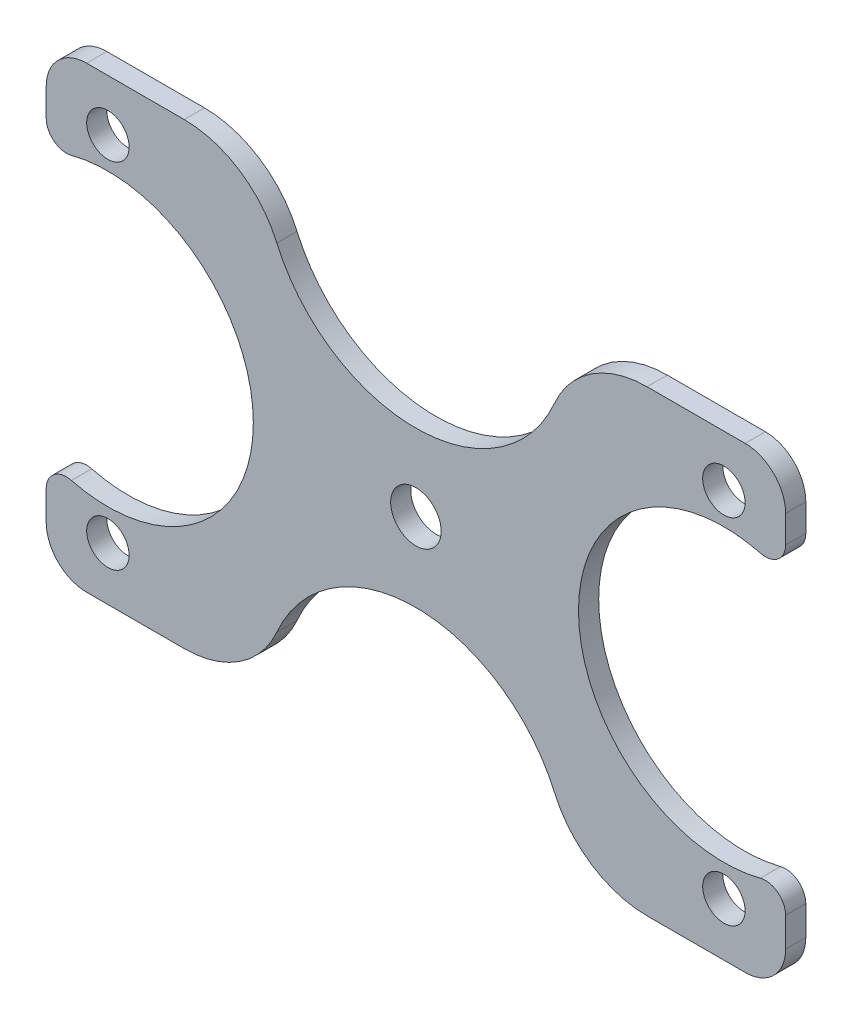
ISO-10303-21;
HEADER;
FILE_DESCRIPTION(('STEP AP214'),'2;1');
FILE_NAME('part.step','',(''),(''),'','','');
FILE_SCHEMA(('AUTOMOTIVE_DESIGN { 1 0 10303 214 1 1 1 1 }'));
ENDSEC;
DATA;
#1=APPLICATION_CONTEXT('core data for automotive mechanical design processes');
#2=APPLICATION_PROTOCOL_DEFINITION('international standard','automotive_design',2000,#1);
#3=PRODUCT_CONTEXT('',#1,'mechanical');
#4=PRODUCT('Part','Part','',(#3));
#5=PRODUCT_RELATED_PRODUCT_CATEGORY('part','',(#4));
#6=PRODUCT_DEFINITION_FORMATION('','',#4);
#7=PRODUCT_DEFINITION_CONTEXT('part definition',#1,'design');
#8=PRODUCT_DEFINITION('design','',#6,#7);
#9=PRODUCT_DEFINITION_SHAPE('','',#8);
#10=(LENGTH_UNIT() NAMED_UNIT(*) SI_UNIT(.MILLI.,.METRE.));
#11=(NAMED_UNIT(*) PLANE_ANGLE_UNIT() SI_UNIT($,.RADIAN.));
#12=(NAMED_UNIT(*) SI_UNIT($,.STERADIAN.) SOLID_ANGLE_UNIT());
#13=UNCERTAINTY_MEASURE_WITH_UNIT(LENGTH_MEASURE(1.E-05),#10,'distance_accuracy_value','');
#14=(GEOMETRIC_REPRESENTATION_CONTEXT(3) GLOBAL_UNCERTAINTY_ASSIGNED_CONTEXT((#13)) GLOBAL_UNIT_ASSIGNED_CONTEXT((#10,
#11,#12)) REPRESENTATION_CONTEXT('',''));
#15=CARTESIAN_POINT('',(0.,0.,0.));
#16=DIRECTION('',(0.,0.,1.));
#17=DIRECTION('',(1.,0.,0.));
#18=AXIS2_PLACEMENT_3D('',#15,#16,#17);
#19=CARTESIAN_POINT('',(32.6101683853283,18.5968085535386,2.));
#20=DIRECTION('',(0.,0.,-1.));
#21=DIRECTION('',(-1.,0.,0.));
#22=AXIS2_PLACEMENT_3D('',#19,#20,#21);
#23=CYLINDRICAL_SURFACE('',#22,4.);
#24=CARTESIAN_POINT('',(32.6101683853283,18.5968085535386,0.));
#25=DIRECTION('',(0.,0.,1.));
#26=DIRECTION('',(1.,0.,0.));
#27=AXIS2_PLACEMENT_3D('',#24,#25,#26);
#28=CIRCLE('',#27,4.);
#29=CARTESIAN_POINT('',(32.6101683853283,22.5968085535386,0.));
#30=VERTEX_POINT('',#29);
#31=CARTESIAN_POINT('',(36.6101683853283,18.5968085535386,0.));
#32=VERTEX_POINT('',#31);
#33=EDGE_CURVE('E239',#30,#32,#28,.F.);
#34=ORIENTED_EDGE('',*,*,#33,.F.);
#35=DIRECTION('',(0.,0.,-1.));
#36=VECTOR('',#35,1.);
#37=CARTESIAN_POINT('',(32.6101683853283,22.5968085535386,2.));
#38=LINE('',#37,#36);
#39=CARTESIAN_POINT('',(32.6101683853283,22.5968085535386,2.));
#40=VERTEX_POINT('',#39);
#41=EDGE_CURVE('E11',#40,#30,#38,.T.);
#42=ORIENTED_EDGE('',*,*,#41,.F.);
#43=CARTESIAN_POINT('',(32.6101683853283,18.5968085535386,2.));
#44=DIRECTION('',(0.,0.,1.));
#45=DIRECTION('',(1.,0.,0.));
#46=AXIS2_PLACEMENT_3D('',#43,#44,#45);
#47=CIRCLE('',#46,4.);
#48=CARTESIAN_POINT('',(36.6101683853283,18.5968085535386,2.));
#49=VERTEX_POINT('',#48);
#50=EDGE_CURVE('E318',#40,#49,#47,.F.);
#51=ORIENTED_EDGE('',*,*,#50,.T.);
#52=DIRECTION('',(0.,0.,-1.));
#53=VECTOR('',#52,1.);
#54=CARTESIAN_POINT('',(36.6101683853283,18.5968085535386,2.));
#55=LINE('',#54,#53);
#56=EDGE_CURVE('E132',#49,#32,#55,.T.);
#57=ORIENTED_EDGE('',*,*,#56,.T.);
#58=EDGE_LOOP('',(#34,#42,#51,#57));
#59=FACE_BOUND('',#58,.T.);
#60=ADVANCED_FACE('F34',(#59),#23,.T.);
#61=CARTESIAN_POINT('',(0.,22.5968085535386,2.));
#62=DIRECTION('',(0.,1.,0.));
#63=DIRECTION('',(0.,0.,1.));
#64=AXIS2_PLACEMENT_3D('',#61,#62,#63);
#65=PLANE('',#64);
#66=DIRECTION('',(1.,0.,0.));
#67=VECTOR('',#66,1.);
#68=CARTESIAN_POINT('',(0.,22.5968085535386,0.));
#69=LINE('',#68,#67);
#70=CARTESIAN_POINT('',(22.8878164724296,22.5968085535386,0.));
#71=VERTEX_POINT('',#70);
#72=EDGE_CURVE('E242',#71,#30,#69,.T.);
#73=ORIENTED_EDGE('',*,*,#72,.F.);
#74=DIRECTION('',(0.,0.,-1.));
#75=VECTOR('',#74,1.);
#76=CARTESIAN_POINT('',(22.8878164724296,22.5968085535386,2.));
#77=LINE('',#76,#75);
#78=CARTESIAN_POINT('',(22.8878164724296,22.5968085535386,2.));
#79=VERTEX_POINT('',#78);
#80=EDGE_CURVE('E42',#79,#71,#77,.T.);
#81=ORIENTED_EDGE('',*,*,#80,.F.);
#82=DIRECTION('',(1.,0.,0.));
#83=VECTOR('',#82,1.);
#84=CARTESIAN_POINT('',(0.,22.5968085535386,2.));
#85=LINE('',#84,#83);
#86=EDGE_CURVE('E376',#79,#40,#85,.T.);
#87=ORIENTED_EDGE('',*,*,#86,.T.);
#88=ORIENTED_EDGE('',*,*,#41,.T.);
#89=EDGE_LOOP('',(#73,#81,#87,#88));
#90=FACE_BOUND('',#89,.T.);
#91=ADVANCED_FACE('F375',(#90),#65,.T.);
#92=CARTESIAN_POINT('',(22.8878164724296,12.5968085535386,2.));
#93=DIRECTION('',(0.,0.,-1.));
#94=DIRECTION('',(-1.,0.,0.));
#95=AXIS2_PLACEMENT_3D('',#92,#93,#94);
#96=CYLINDRICAL_SURFACE('',#95,10.);
#97=CARTESIAN_POINT('',(22.8878164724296,12.5968085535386,0.));
#98=DIRECTION('',(0.,0.,1.));
#99=DIRECTION('',(1.,0.,0.));
#100=AXIS2_PLACEMENT_3D('',#97,#98,#99);
#101=CIRCLE('',#100,10.);
#102=CARTESIAN_POINT('',(13.7226650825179,16.5968085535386,0.));
#103=VERTEX_POINT('',#102);
#104=EDGE_CURVE('E245',#71,#103,#101,.T.);
#105=ORIENTED_EDGE('',*,*,#104,.T.);
#106=DIRECTION('',(0.,0.,-1.));
#107=VECTOR('',#106,1.);
#108=CARTESIAN_POINT('',(13.7226650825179,16.5968085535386,2.));
#109=LINE('',#108,#107);
#110=CARTESIAN_POINT('',(13.7226650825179,16.5968085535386,2.));
#111=VERTEX_POINT('',#110);
#112=EDGE_CURVE('E360',#111,#103,#109,.T.);
#113=ORIENTED_EDGE('',*,*,#112,.F.);
#114=CARTESIAN_POINT('',(22.8878164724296,12.5968085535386,2.));
#115=DIRECTION('',(0.,0.,1.));
#116=DIRECTION('',(1.,0.,0.));
#117=AXIS2_PLACEMENT_3D('',#114,#115,#116);
#118=CIRCLE('',#117,10.);
#119=EDGE_CURVE('E366',#79,#111,#118,.T.);
#120=ORIENTED_EDGE('',*,*,#119,.F.);
#121=ORIENTED_EDGE('',*,*,#80,.T.);
#122=EDGE_LOOP('',(#105,#113,#120,#121));
#123=FACE_BOUND('',#122,.T.);
#124=ADVANCED_FACE('F364',(#123),#96,.T.);
#125=CARTESIAN_POINT('',(-0.0250620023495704,22.5968085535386,2.));
#126=DIRECTION('',(0.,0.,-1.));
#127=DIRECTION('',(-1.,0.,0.));
#128=AXIS2_PLACEMENT_3D('',#125,#126,#127);
#129=CYLINDRICAL_SURFACE('',#128,15.);
#130=CARTESIAN_POINT('',(-0.0250620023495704,22.5968085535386,0.));
#131=DIRECTION('',(0.,0.,1.));
#132=DIRECTION('',(1.,0.,0.));
#133=AXIS2_PLACEMENT_3D('',#130,#131,#132);
#134=CIRCLE('',#133,15.);
#135=CARTESIAN_POINT('',(-13.7727890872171,16.5968085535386,0.));
#136=VERTEX_POINT('',#135);
#137=EDGE_CURVE('E248',#136,#103,#134,.T.);
#138=ORIENTED_EDGE('',*,*,#137,.F.);
#139=DIRECTION('',(0.,0.,-1.));
#140=VECTOR('',#139,1.);
#141=CARTESIAN_POINT('',(-13.7727890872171,16.5968085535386,2.));
#142=LINE('',#141,#140);
#143=CARTESIAN_POINT('',(-13.7727890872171,16.5968085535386,2.));
#144=VERTEX_POINT('',#143);
#145=EDGE_CURVE('E358',#144,#136,#142,.T.);
#146=ORIENTED_EDGE('',*,*,#145,.F.);
#147=CARTESIAN_POINT('',(-0.0250620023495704,22.5968085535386,2.));
#148=DIRECTION('',(0.,0.,1.));
#149=DIRECTION('',(1.,0.,0.));
#150=AXIS2_PLACEMENT_3D('',#147,#148,#149);
#151=CIRCLE('',#150,15.);
#152=EDGE_CURVE('E382',#144,#111,#151,.T.);
#153=ORIENTED_EDGE('',*,*,#152,.T.);
#154=ORIENTED_EDGE('',*,*,#112,.T.);
#155=EDGE_LOOP('',(#138,#146,#153,#154));
#156=FACE_BOUND('',#155,.T.);
#157=ADVANCED_FACE('F499',(#156),#129,.F.);
#158=CARTESIAN_POINT('',(-22.9379404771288,12.5968085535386,2.));
#159=DIRECTION('',(0.,0.,-1.));
#160=DIRECTION('',(-1.,0.,0.));
#161=AXIS2_PLACEMENT_3D('',#158,#159,#160);
#162=CYLINDRICAL_SURFACE('',#161,10.);
#163=CARTESIAN_POINT('',(-22.9379404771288,12.5968085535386,0.));
#164=DIRECTION('',(0.,0.,1.));
#165=DIRECTION('',(1.,0.,0.));
#166=AXIS2_PLACEMENT_3D('',#163,#164,#165);
#167=CIRCLE('',#166,10.);
#168=CARTESIAN_POINT('',(-22.9379404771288,22.5968085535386,0.));
#169=VERTEX_POINT('',#168);
#170=EDGE_CURVE('E251',#169,#136,#167,.F.);
#171=ORIENTED_EDGE('',*,*,#170,.F.);
#172=DIRECTION('',(0.,0.,-1.));
#173=VECTOR('',#172,1.);
#174=CARTESIAN_POINT('',(-22.9379404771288,22.5968085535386,2.));
#175=LINE('',#174,#173);
#176=CARTESIAN_POINT('',(-22.9379404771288,22.5968085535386,2.));
#177=VERTEX_POINT('',#176);
#178=EDGE_CURVE('E356',#177,#169,#175,.T.);
#179=ORIENTED_EDGE('',*,*,#178,.F.);
#180=CARTESIAN_POINT('',(-22.9379404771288,12.5968085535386,2.));
#181=DIRECTION('',(0.,0.,1.));
#182=DIRECTION('',(1.,0.,0.));
#183=AXIS2_PLACEMENT_3D('',#180,#181,#182);
#184=CIRCLE('',#183,10.);
#185=EDGE_CURVE('E385',#177,#144,#184,.F.);
#186=ORIENTED_EDGE('',*,*,#185,.T.);
#187=ORIENTED_EDGE('',*,*,#145,.T.);
#188=EDGE_LOOP('',(#171,#179,#186,#187));
#189=FACE_BOUND('',#188,.T.);
#190=ADVANCED_FACE('F496',(#189),#162,.T.);
#191=CARTESIAN_POINT('',(0.,22.5968085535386,2.));
#192=DIRECTION('',(0.,1.,0.));
#193=DIRECTION('',(0.,0.,1.));
#194=AXIS2_PLACEMENT_3D('',#191,#192,#193);
#195=PLANE('',#194);
#196=DIRECTION('',(1.,0.,0.));
#197=VECTOR('',#196,1.);
#198=CARTESIAN_POINT('',(0.,22.5968085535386,0.));
#199=LINE('',#198,#197);
#200=CARTESIAN_POINT('',(-32.6101683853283,22.5968085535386,0.));
#201=VERTEX_POINT('',#200);
#202=EDGE_CURVE('E254',#201,#169,#199,.T.);
#203=ORIENTED_EDGE('',*,*,#202,.F.);
#204=DIRECTION('',(0.,0.,-1.));
#205=VECTOR('',#204,1.);
#206=CARTESIAN_POINT('',(-32.6101683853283,22.5968085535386,2.));
#207=LINE('',#206,#205);
#208=CARTESIAN_POINT('',(-32.6101683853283,22.5968085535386,2.));
#209=VERTEX_POINT('',#208);
#210=EDGE_CURVE('E354',#209,#201,#207,.T.);
#211=ORIENTED_EDGE('',*,*,#210,.F.);
#212=DIRECTION('',(1.,0.,0.));
#213=VECTOR('',#212,1.);
#214=CARTESIAN_POINT('',(0.,22.5968085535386,2.));
#215=LINE('',#214,#213);
#216=EDGE_CURVE('E388',#209,#177,#215,.T.);
#217=ORIENTED_EDGE('',*,*,#216,.T.);
#218=ORIENTED_EDGE('',*,*,#178,.T.);
#219=EDGE_LOOP('',(#203,#211,#217,#218));
#220=FACE_BOUND('',#219,.T.);
#221=ADVANCED_FACE('F492',(#220),#195,.T.);
#222=CARTESIAN_POINT('',(-32.6101683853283,18.5968085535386,2.));
#223=DIRECTION('',(0.,0.,-1.));
#224=DIRECTION('',(-1.,0.,0.));
#225=AXIS2_PLACEMENT_3D('',#222,#223,#224);
#226=CYLINDRICAL_SURFACE('',#225,4.);
#227=CARTESIAN_POINT('',(-32.6101683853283,18.5968085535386,0.));
#228=DIRECTION('',(0.,0.,1.));
#229=DIRECTION('',(1.,0.,0.));
#230=AXIS2_PLACEMENT_3D('',#227,#228,#229);
#231=CIRCLE('',#230,4.);
#232=CARTESIAN_POINT('',(-36.6101683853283,18.5968085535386,0.));
#233=VERTEX_POINT('',#232);
#234=EDGE_CURVE('E257',#233,#201,#231,.F.);
#235=ORIENTED_EDGE('',*,*,#234,.F.);
#236=DIRECTION('',(0.,0.,-1.));
#237=VECTOR('',#236,1.);
#238=CARTESIAN_POINT('',(-36.6101683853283,18.5968085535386,2.));
#239=LINE('',#238,#237);
#240=CARTESIAN_POINT('',(-36.6101683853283,18.5968085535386,2.));
#241=VERTEX_POINT('',#240);
#242=EDGE_CURVE('E352',#241,#233,#239,.T.);
#243=ORIENTED_EDGE('',*,*,#242,.F.);
#244=CARTESIAN_POINT('',(-32.6101683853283,18.5968085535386,2.));
#245=DIRECTION('',(0.,0.,1.));
#246=DIRECTION('',(1.,0.,0.));
#247=AXIS2_PLACEMENT_3D('',#244,#245,#246);
#248=CIRCLE('',#247,4.);
#249=EDGE_CURVE('E391',#241,#209,#248,.F.);
#250=ORIENTED_EDGE('',*,*,#249,.T.);
#251=ORIENTED_EDGE('',*,*,#210,.T.);
#252=EDGE_LOOP('',(#235,#243,#250,#251));
#253=FACE_BOUND('',#252,.T.);
#254=ADVANCED_FACE('F488',(#253),#226,.T.);
#255=CARTESIAN_POINT('',(-36.6101683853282,0.,2.));
#256=DIRECTION('',(-1.,0.,0.));
#257=DIRECTION('',(0.,-1.,0.));
#258=AXIS2_PLACEMENT_3D('',#255,#256,#257);
#259=PLANE('',#258);
#260=DIRECTION('',(0.,1.,0.));
#261=VECTOR('',#260,1.);
#262=CARTESIAN_POINT('',(-36.6101683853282,0.,0.));
#263=LINE('',#262,#261);
#264=CARTESIAN_POINT('',(-36.6101683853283,15.8766027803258,0.));
#265=VERTEX_POINT('',#264);
#266=EDGE_CURVE('E260',#265,#233,#263,.T.);
#267=ORIENTED_EDGE('',*,*,#266,.F.);
#268=DIRECTION('',(0.,0.,-1.));
#269=VECTOR('',#268,1.);
#270=CARTESIAN_POINT('',(-36.6101683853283,15.8766027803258,2.));
#271=LINE('',#270,#269);
#272=CARTESIAN_POINT('',(-36.6101683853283,15.8766027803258,2.));
#273=VERTEX_POINT('',#272);
#274=EDGE_CURVE('E350',#273,#265,#271,.T.);
#275=ORIENTED_EDGE('',*,*,#274,.F.);
#276=DIRECTION('',(0.,1.,0.));
#277=VECTOR('',#276,1.);
#278=CARTESIAN_POINT('',(-36.6101683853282,0.,2.));
#279=LINE('',#278,#277);
#280=EDGE_CURVE('E394',#273,#241,#279,.T.);
#281=ORIENTED_EDGE('',*,*,#280,.T.);
#282=ORIENTED_EDGE('',*,*,#242,.T.);
#283=EDGE_LOOP('',(#267,#275,#281,#282));
#284=FACE_BOUND('',#283,.T.);
#285=ADVANCED_FACE('F482',(#284),#259,.T.);
#286=CARTESIAN_POINT('',(-34.6101683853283,15.8766027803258,2.));
#287=DIRECTION('',(0.,0.,-1.));
#288=DIRECTION('',(-1.,0.,0.));
#289=AXIS2_PLACEMENT_3D('',#286,#287,#288);
#290=CYLINDRICAL_SURFACE('',#289,2.);
#291=CARTESIAN_POINT('',(-34.6101683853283,15.8766027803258,0.));
#292=DIRECTION('',(0.,0.,1.));
#293=DIRECTION('',(1.,0.,0.));
#294=AXIS2_PLACEMENT_3D('',#291,#292,#293);
#295=CIRCLE('',#294,2.);
#296=CARTESIAN_POINT('',(-34.108928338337,13.9404317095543,0.));
#297=VERTEX_POINT('',#296);
#298=EDGE_CURVE('E263',#265,#297,#295,.T.);
#299=ORIENTED_EDGE('',*,*,#298,.T.);
#300=DIRECTION('',(0.,0.,-1.));
#301=VECTOR('',#300,1.);
#302=CARTESIAN_POINT('',(-34.108928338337,13.9404317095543,2.));
#303=LINE('',#302,#301);
#304=CARTESIAN_POINT('',(-34.108928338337,13.9404317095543,2.));
#305=VERTEX_POINT('',#304);
#306=EDGE_CURVE('E347',#305,#297,#303,.T.);
#307=ORIENTED_EDGE('',*,*,#306,.F.);
#308=CARTESIAN_POINT('',(-34.6101683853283,15.8766027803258,2.));
#309=DIRECTION('',(0.,0.,1.));
#310=DIRECTION('',(1.,0.,0.));
#311=AXIS2_PLACEMENT_3D('',#308,#309,#310);
#312=CIRCLE('',#311,2.);
#313=EDGE_CURVE('E397',#273,#305,#312,.T.);
#314=ORIENTED_EDGE('',*,*,#313,.F.);
#315=ORIENTED_EDGE('',*,*,#274,.T.);
#316=EDGE_LOOP('',(#299,#307,#314,#315));
#317=FACE_BOUND('',#316,.T.);
#318=ADVANCED_FACE('F500',(#317),#290,.T.);
#319=CARTESIAN_POINT('',(-30.5,0.,2.));
#320=DIRECTION('',(0.,0.,-1.));
#321=DIRECTION('',(-1.,0.,0.));
#322=AXIS2_PLACEMENT_3D('',#319,#320,#321);
#323=CYLINDRICAL_SURFACE('',#322,14.4);
#324=CARTESIAN_POINT('',(-30.5,0.,0.));
#325=DIRECTION('',(0.,0.,1.));
#326=DIRECTION('',(1.,0.,0.));
#327=AXIS2_PLACEMENT_3D('',#324,#325,#326);
#328=CIRCLE('',#327,14.4);
#329=CARTESIAN_POINT('',(-34.108928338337,-13.9404317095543,0.));
#330=VERTEX_POINT('',#329);
#331=EDGE_CURVE('E265',#297,#330,#328,.F.);
#332=ORIENTED_EDGE('',*,*,#331,.T.);
#333=DIRECTION('',(0.,0.,-1.));
#334=VECTOR('',#333,1.);
#335=CARTESIAN_POINT('',(-34.108928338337,-13.9404317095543,2.));
#336=LINE('',#335,#334);
#337=CARTESIAN_POINT('',(-34.108928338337,-13.9404317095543,2.));
#338=VERTEX_POINT('',#337);
#339=EDGE_CURVE('E344',#338,#330,#336,.T.);
#340=ORIENTED_EDGE('',*,*,#339,.F.);
#341=CARTESIAN_POINT('',(-30.5,0.,2.));
#342=DIRECTION('',(0.,0.,1.));
#343=DIRECTION('',(1.,0.,0.));
#344=AXIS2_PLACEMENT_3D('',#341,#342,#343);
#345=CIRCLE('',#344,14.4);
#346=EDGE_CURVE('E399',#305,#338,#345,.F.);
#347=ORIENTED_EDGE('',*,*,#346,.F.);
#348=ORIENTED_EDGE('',*,*,#306,.T.);
#349=EDGE_LOOP('',(#332,#340,#347,#348));
#350=FACE_BOUND('',#349,.T.);
#351=ADVANCED_FACE('F476',(#350),#323,.F.);
#352=CARTESIAN_POINT('',(-34.6101683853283,-15.8766027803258,2.));
#353=DIRECTION('',(0.,0.,-1.));
#354=DIRECTION('',(-1.,0.,0.));
#355=AXIS2_PLACEMENT_3D('',#352,#353,#354);
#356=CYLINDRICAL_SURFACE('',#355,2.);
#357=CARTESIAN_POINT('',(-34.6101683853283,-15.8766027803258,0.));
#358=DIRECTION('',(0.,0.,1.));
#359=DIRECTION('',(1.,0.,0.));
#360=AXIS2_PLACEMENT_3D('',#357,#358,#359);
#361=CIRCLE('',#360,2.);
#362=CARTESIAN_POINT('',(-36.6101683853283,-15.8766027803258,0.));
#363=VERTEX_POINT('',#362);
#364=EDGE_CURVE('E267',#330,#363,#361,.T.);
#365=ORIENTED_EDGE('',*,*,#364,.T.);
#366=DIRECTION('',(0.,0.,-1.));
#367=VECTOR('',#366,1.);
#368=CARTESIAN_POINT('',(-36.6101683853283,-15.8766027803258,2.));
#369=LINE('',#368,#367);
#370=CARTESIAN_POINT('',(-36.6101683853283,-15.8766027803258,2.));
#371=VERTEX_POINT('',#370);
#372=EDGE_CURVE('E341',#371,#363,#369,.T.);
#373=ORIENTED_EDGE('',*,*,#372,.F.);
#374=CARTESIAN_POINT('',(-34.6101683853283,-15.8766027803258,2.));
#375=DIRECTION('',(0.,0.,1.));
#376=DIRECTION('',(1.,0.,0.));
#377=AXIS2_PLACEMENT_3D('',#374,#375,#376);
#378=CIRCLE('',#377,2.);
#379=EDGE_CURVE('E401',#338,#371,#378,.T.);
#380=ORIENTED_EDGE('',*,*,#379,.F.);
#381=ORIENTED_EDGE('',*,*,#339,.T.);
#382=EDGE_LOOP('',(#365,#373,#380,#381));
#383=FACE_BOUND('',#382,.T.);
#384=ADVANCED_FACE('F472',(#383),#356,.T.);
#385=CARTESIAN_POINT('',(-36.6101683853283,0.,2.));
#386=DIRECTION('',(1.,0.,0.));
#387=DIRECTION('',(0.,0.,-1.));
#388=AXIS2_PLACEMENT_3D('',#385,#386,#387);
#389=PLANE('',#388);
#390=DIRECTION('',(0.,-1.,0.));
#391=VECTOR('',#390,1.);
#392=CARTESIAN_POINT('',(-36.6101683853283,0.,0.));
#393=LINE('',#392,#391);
#394=CARTESIAN_POINT('',(-36.6101683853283,-18.7777972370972,0.));
#395=VERTEX_POINT('',#394);
#396=EDGE_CURVE('E269',#363,#395,#393,.T.);
#397=ORIENTED_EDGE('',*,*,#396,.T.);
#398=DIRECTION('',(0.,0.,-1.));
#399=VECTOR('',#398,1.);
#400=CARTESIAN_POINT('',(-36.6101683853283,-18.7777972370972,2.));
#401=LINE('',#400,#399);
#402=CARTESIAN_POINT('',(-36.6101683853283,-18.7777972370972,2.));
#403=VERTEX_POINT('',#402);
#404=EDGE_CURVE('E339',#403,#395,#401,.T.);
#405=ORIENTED_EDGE('',*,*,#404,.F.);
#406=DIRECTION('',(0.,-1.,0.));
#407=VECTOR('',#406,1.);
#408=CARTESIAN_POINT('',(-36.6101683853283,0.,2.));
#409=LINE('',#408,#407);
#410=EDGE_CURVE('E403',#371,#403,#409,.T.);
#411=ORIENTED_EDGE('',*,*,#410,.F.);
#412=ORIENTED_EDGE('',*,*,#372,.T.);
#413=EDGE_LOOP('',(#397,#405,#411,#412));
#414=FACE_BOUND('',#413,.T.);
#415=ADVANCED_FACE('F467',(#414),#389,.F.);
#416=CARTESIAN_POINT('',(-32.6101683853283,-18.7777972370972,2.));
#417=DIRECTION('',(0.,0.,-1.));
#418=DIRECTION('',(-1.,0.,0.));
#419=AXIS2_PLACEMENT_3D('',#416,#417,#418);
#420=CYLINDRICAL_SURFACE('',#419,4.);
#421=CARTESIAN_POINT('',(-32.6101683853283,-18.7777972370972,0.));
#422=DIRECTION('',(0.,0.,1.));
#423=DIRECTION('',(1.,0.,0.));
#424=AXIS2_PLACEMENT_3D('',#421,#422,#423);
#425=CIRCLE('',#424,4.);
#426=CARTESIAN_POINT('',(-32.6101683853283,-22.7777972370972,0.));
#427=VERTEX_POINT('',#426);
#428=EDGE_CURVE('E272',#427,#395,#425,.F.);
#429=ORIENTED_EDGE('',*,*,#428,.F.);
#430=DIRECTION('',(0.,0.,-1.));
#431=VECTOR('',#430,1.);
#432=CARTESIAN_POINT('',(-32.6101683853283,-22.7777972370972,2.));
#433=LINE('',#432,#431);
#434=CARTESIAN_POINT('',(-32.6101683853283,-22.7777972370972,2.));
#435=VERTEX_POINT('',#434);
#436=EDGE_CURVE('E337',#435,#427,#433,.T.);
#437=ORIENTED_EDGE('',*,*,#436,.F.);
#438=CARTESIAN_POINT('',(-32.6101683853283,-18.7777972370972,2.));
#439=DIRECTION('',(0.,0.,1.));
#440=DIRECTION('',(1.,0.,0.));
#441=AXIS2_PLACEMENT_3D('',#438,#439,#440);
#442=CIRCLE('',#441,4.);
#443=EDGE_CURVE('E405',#435,#403,#442,.F.);
#444=ORIENTED_EDGE('',*,*,#443,.T.);
#445=ORIENTED_EDGE('',*,*,#404,.T.);
#446=EDGE_LOOP('',(#429,#437,#444,#445));
#447=FACE_BOUND('',#446,.T.);
#448=ADVANCED_FACE('F461',(#447),#420,.T.);
#449=CARTESIAN_POINT('',(0.,-22.7777972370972,2.));
#450=DIRECTION('',(0.,-1.,0.));
#451=DIRECTION('',(0.,0.,-1.));
#452=AXIS2_PLACEMENT_3D('',#449,#450,#451);
#453=PLANE('',#452);
#454=DIRECTION('',(-1.,0.,0.));
#455=VECTOR('',#454,1.);
#456=CARTESIAN_POINT('',(0.,-22.7777972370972,0.));
#457=LINE('',#456,#455);
#458=CARTESIAN_POINT('',(-22.9379404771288,-22.7777972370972,0.));
#459=VERTEX_POINT('',#458);
#460=EDGE_CURVE('E275',#459,#427,#457,.T.);
#461=ORIENTED_EDGE('',*,*,#460,.F.);
#462=DIRECTION('',(0.,0.,-1.));
#463=VECTOR('',#462,1.);
#464=CARTESIAN_POINT('',(-22.9379404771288,-22.7777972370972,2.));
#465=LINE('',#464,#463);
#466=CARTESIAN_POINT('',(-22.9379404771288,-22.7777972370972,2.));
#467=VERTEX_POINT('',#466);
#468=EDGE_CURVE('E335',#467,#459,#465,.T.);
#469=ORIENTED_EDGE('',*,*,#468,.F.);
#470=DIRECTION('',(-1.,0.,0.));
#471=VECTOR('',#470,1.);
#472=CARTESIAN_POINT('',(0.,-22.7777972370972,2.));
#473=LINE('',#472,#471);
#474=EDGE_CURVE('E408',#467,#435,#473,.T.);
#475=ORIENTED_EDGE('',*,*,#474,.T.);
#476=ORIENTED_EDGE('',*,*,#436,.T.);
#477=EDGE_LOOP('',(#461,#469,#475,#476));
#478=FACE_BOUND('',#477,.T.);
#479=ADVANCED_FACE('F457',(#478),#453,.T.);
#480=CARTESIAN_POINT('',(-22.9379404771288,-12.7777972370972,2.));
#481=DIRECTION('',(0.,0.,-1.));
#482=DIRECTION('',(-1.,0.,0.));
#483=AXIS2_PLACEMENT_3D('',#480,#481,#482);
#484=CYLINDRICAL_SURFACE('',#483,10.);
#485=CARTESIAN_POINT('',(-22.9379404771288,-12.7777972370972,0.));
#486=DIRECTION('',(0.,0.,1.));
#487=DIRECTION('',(1.,0.,0.));
#488=AXIS2_PLACEMENT_3D('',#485,#486,#487);
#489=CIRCLE('',#488,10.);
#490=CARTESIAN_POINT('',(-13.7727890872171,-16.7777972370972,0.));
#491=VERTEX_POINT('',#490);
#492=EDGE_CURVE('E278',#459,#491,#489,.T.);
#493=ORIENTED_EDGE('',*,*,#492,.T.);
#494=DIRECTION('',(0.,0.,-1.));
#495=VECTOR('',#494,1.);
#496=CARTESIAN_POINT('',(-13.7727890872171,-16.7777972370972,2.));
#497=LINE('',#496,#495);
#498=CARTESIAN_POINT('',(-13.7727890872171,-16.7777972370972,2.));
#499=VERTEX_POINT('',#498);
#500=EDGE_CURVE('E332',#499,#491,#497,.T.);
#501=ORIENTED_EDGE('',*,*,#500,.F.);
#502=CARTESIAN_POINT('',(-22.9379404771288,-12.7777972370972,2.));
#503=DIRECTION('',(0.,0.,1.));
#504=DIRECTION('',(1.,0.,0.));
#505=AXIS2_PLACEMENT_3D('',#502,#503,#504);
#506=CIRCLE('',#505,10.);
#507=EDGE_CURVE('E411',#467,#499,#506,.T.);
#508=ORIENTED_EDGE('',*,*,#507,.F.);
#509=ORIENTED_EDGE('',*,*,#468,.T.);
#510=EDGE_LOOP('',(#493,#501,#508,#509));
#511=FACE_BOUND('',#510,.T.);
#512=ADVANCED_FACE('F453',(#511),#484,.T.);
#513=CARTESIAN_POINT('',(-0.0250620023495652,-22.7777972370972,2.));
#514=DIRECTION('',(0.,0.,-1.));
#515=DIRECTION('',(-1.,0.,0.));
#516=AXIS2_PLACEMENT_3D('',#513,#514,#515);
#517=CYLINDRICAL_SURFACE('',#516,15.);
#518=CARTESIAN_POINT('',(-0.0250620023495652,-22.7777972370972,0.));
#519=DIRECTION('',(0.,0.,1.));
#520=DIRECTION('',(1.,0.,0.));
#521=AXIS2_PLACEMENT_3D('',#518,#519,#520);
#522=CIRCLE('',#521,15.);
#523=CARTESIAN_POINT('',(13.722665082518,-16.7777972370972,0.));
#524=VERTEX_POINT('',#523);
#525=EDGE_CURVE('E280',#491,#524,#522,.F.);
#526=ORIENTED_EDGE('',*,*,#525,.T.);
#527=DIRECTION('',(0.,0.,-1.));
#528=VECTOR('',#527,1.);
#529=CARTESIAN_POINT('',(13.722665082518,-16.7777972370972,2.));
#530=LINE('',#529,#528);
#531=CARTESIAN_POINT('',(13.722665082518,-16.7777972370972,2.));
#532=VERTEX_POINT('',#531);
#533=EDGE_CURVE('E330',#532,#524,#530,.T.);
#534=ORIENTED_EDGE('',*,*,#533,.F.);
#535=CARTESIAN_POINT('',(-0.0250620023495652,-22.7777972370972,2.));
#536=DIRECTION('',(0.,0.,1.));
#537=DIRECTION('',(1.,0.,0.));
#538=AXIS2_PLACEMENT_3D('',#535,#536,#537);
#539=CIRCLE('',#538,15.);
#540=EDGE_CURVE('E413',#499,#532,#539,.F.);
#541=ORIENTED_EDGE('',*,*,#540,.F.);
#542=ORIENTED_EDGE('',*,*,#500,.T.);
#543=EDGE_LOOP('',(#526,#534,#541,#542));
#544=FACE_BOUND('',#543,.T.);
#545=ADVANCED_FACE('F449',(#544),#517,.F.);
#546=CARTESIAN_POINT('',(22.8878164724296,-12.7777972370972,2.));
#547=DIRECTION('',(0.,0.,-1.));
#548=DIRECTION('',(-1.,0.,0.));
#549=AXIS2_PLACEMENT_3D('',#546,#547,#548);
#550=CYLINDRICAL_SURFACE('',#549,10.);
#551=CARTESIAN_POINT('',(22.8878164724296,-12.7777972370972,0.));
#552=DIRECTION('',(0.,0.,1.));
#553=DIRECTION('',(1.,0.,0.));
#554=AXIS2_PLACEMENT_3D('',#551,#552,#553);
#555=CIRCLE('',#554,10.);
#556=CARTESIAN_POINT('',(22.8878164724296,-22.7777972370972,0.));
#557=VERTEX_POINT('',#556);
#558=EDGE_CURVE('E283',#557,#524,#555,.F.);
#559=ORIENTED_EDGE('',*,*,#558,.F.);
#560=DIRECTION('',(0.,0.,-1.));
#561=VECTOR('',#560,1.);
#562=CARTESIAN_POINT('',(22.8878164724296,-22.7777972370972,2.));
#563=LINE('',#562,#561);
#564=CARTESIAN_POINT('',(22.8878164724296,-22.7777972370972,2.));
#565=VERTEX_POINT('',#564);
#566=EDGE_CURVE('E328',#565,#557,#563,.T.);
#567=ORIENTED_EDGE('',*,*,#566,.F.);
#568=CARTESIAN_POINT('',(22.8878164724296,-12.7777972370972,2.));
#569=DIRECTION('',(0.,0.,1.));
#570=DIRECTION('',(1.,0.,0.));
#571=AXIS2_PLACEMENT_3D('',#568,#569,#570);
#572=CIRCLE('',#571,10.);
#573=EDGE_CURVE('E415',#565,#532,#572,.F.);
#574=ORIENTED_EDGE('',*,*,#573,.T.);
#575=ORIENTED_EDGE('',*,*,#533,.T.);
#576=EDGE_LOOP('',(#559,#567,#574,#575));
#577=FACE_BOUND('',#576,.T.);
#578=ADVANCED_FACE('F444',(#577),#550,.T.);
#579=CARTESIAN_POINT('',(0.,-22.7777972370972,2.));
#580=DIRECTION('',(0.,-1.,0.));
#581=DIRECTION('',(1.,0.,0.));
#582=AXIS2_PLACEMENT_3D('',#579,#580,#581);
#583=PLANE('',#582);
#584=DIRECTION('',(-1.,0.,0.));
#585=VECTOR('',#584,1.);
#586=CARTESIAN_POINT('',(0.,-22.7777972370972,0.));
#587=LINE('',#586,#585);
#588=CARTESIAN_POINT('',(32.6101683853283,-22.7777972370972,0.));
#589=VERTEX_POINT('',#588);
#590=EDGE_CURVE('E286',#589,#557,#587,.T.);
#591=ORIENTED_EDGE('',*,*,#590,.F.);
#592=DIRECTION('',(0.,0.,-1.));
#593=VECTOR('',#592,1.);
#594=CARTESIAN_POINT('',(32.6101683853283,-22.7777972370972,2.));
#595=LINE('',#594,#593);
#596=CARTESIAN_POINT('',(32.6101683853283,-22.7777972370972,2.));
#597=VERTEX_POINT('',#596);
#598=EDGE_CURVE('E326',#597,#589,#595,.T.);
#599=ORIENTED_EDGE('',*,*,#598,.F.);
#600=DIRECTION('',(-1.,0.,0.));
#601=VECTOR('',#600,1.);
#602=CARTESIAN_POINT('',(0.,-22.7777972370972,2.));
#603=LINE('',#602,#601);
#604=EDGE_CURVE('E418',#597,#565,#603,.T.);
#605=ORIENTED_EDGE('',*,*,#604,.T.);
#606=ORIENTED_EDGE('',*,*,#566,.T.);
#607=EDGE_LOOP('',(#591,#599,#605,#606));
#608=FACE_BOUND('',#607,.T.);
#609=ADVANCED_FACE('F439',(#608),#583,.T.);
#610=CARTESIAN_POINT('',(32.6101683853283,-18.7777972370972,2.));
#611=DIRECTION('',(0.,0.,-1.));
#612=DIRECTION('',(-1.,0.,0.));
#613=AXIS2_PLACEMENT_3D('',#610,#611,#612);
#614=CYLINDRICAL_SURFACE('',#613,4.);
#615=CARTESIAN_POINT('',(32.6101683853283,-18.7777972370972,0.));
#616=DIRECTION('',(0.,0.,1.));
#617=DIRECTION('',(1.,0.,0.));
#618=AXIS2_PLACEMENT_3D('',#615,#616,#617);
#619=CIRCLE('',#618,4.);
#620=CARTESIAN_POINT('',(36.6101683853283,-18.7777972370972,0.));
#621=VERTEX_POINT('',#620);
#622=EDGE_CURVE('E289',#621,#589,#619,.F.);
#623=ORIENTED_EDGE('',*,*,#622,.F.);
#624=DIRECTION('',(0.,0.,-1.));
#625=VECTOR('',#624,1.);
#626=CARTESIAN_POINT('',(36.6101683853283,-18.7777972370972,2.));
#627=LINE('',#626,#625);
#628=CARTESIAN_POINT('',(36.6101683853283,-18.7777972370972,2.));
#629=VERTEX_POINT('',#628);
#630=EDGE_CURVE('E324',#629,#621,#627,.T.);
#631=ORIENTED_EDGE('',*,*,#630,.F.);
#632=CARTESIAN_POINT('',(32.6101683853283,-18.7777972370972,2.));
#633=DIRECTION('',(0.,0.,1.));
#634=DIRECTION('',(1.,0.,0.));
#635=AXIS2_PLACEMENT_3D('',#632,#633,#634);
#636=CIRCLE('',#635,4.);
#637=EDGE_CURVE('E421',#629,#597,#636,.F.);
#638=ORIENTED_EDGE('',*,*,#637,.T.);
#639=ORIENTED_EDGE('',*,*,#598,.T.);
#640=EDGE_LOOP('',(#623,#631,#638,#639));
#641=FACE_BOUND('',#640,.T.);
#642=ADVANCED_FACE('F435',(#641),#614,.T.);
#643=CARTESIAN_POINT('',(36.6101683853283,0.,2.));
#644=DIRECTION('',(1.,0.,0.));
#645=DIRECTION('',(0.,1.,0.));
#646=AXIS2_PLACEMENT_3D('',#643,#644,#645);
#647=PLANE('',#646);
#648=DIRECTION('',(0.,-1.,0.));
#649=VECTOR('',#648,1.);
#650=CARTESIAN_POINT('',(36.6101683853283,0.,0.));
#651=LINE('',#650,#649);
#652=CARTESIAN_POINT('',(36.6101683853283,-15.8766027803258,0.));
#653=VERTEX_POINT('',#652);
#654=EDGE_CURVE('E292',#653,#621,#651,.T.);
#655=ORIENTED_EDGE('',*,*,#654,.F.);
#656=DIRECTION('',(0.,0.,-1.));
#657=VECTOR('',#656,1.);
#658=CARTESIAN_POINT('',(36.6101683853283,-15.8766027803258,2.));
#659=LINE('',#658,#657);
#660=CARTESIAN_POINT('',(36.6101683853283,-15.8766027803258,2.));
#661=VERTEX_POINT('',#660);
#662=EDGE_CURVE('E322',#661,#653,#659,.T.);
#663=ORIENTED_EDGE('',*,*,#662,.F.);
#664=DIRECTION('',(0.,-1.,0.));
#665=VECTOR('',#664,1.);
#666=CARTESIAN_POINT('',(36.6101683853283,0.,2.));
#667=LINE('',#666,#665);
#668=EDGE_CURVE('E424',#661,#629,#667,.T.);
#669=ORIENTED_EDGE('',*,*,#668,.T.);
#670=ORIENTED_EDGE('',*,*,#630,.T.);
#671=EDGE_LOOP('',(#655,#663,#669,#670));
#672=FACE_BOUND('',#671,.T.);
#673=ADVANCED_FACE('F432',(#672),#647,.T.);
#674=CARTESIAN_POINT('',(34.6101683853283,-15.8766027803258,2.));
#675=DIRECTION('',(0.,0.,-1.));
#676=DIRECTION('',(-1.,0.,0.));
#677=AXIS2_PLACEMENT_3D('',#674,#675,#676);
#678=CYLINDRICAL_SURFACE('',#677,2.);
#679=CARTESIAN_POINT('',(34.6101683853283,-15.8766027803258,0.));
#680=DIRECTION('',(0.,0.,1.));
#681=DIRECTION('',(1.,0.,0.));
#682=AXIS2_PLACEMENT_3D('',#679,#680,#681);
#683=CIRCLE('',#682,2.);
#684=CARTESIAN_POINT('',(34.108928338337,-13.9404317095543,0.));
#685=VERTEX_POINT('',#684);
#686=EDGE_CURVE('E295',#685,#653,#683,.F.);
#687=ORIENTED_EDGE('',*,*,#686,.F.);
#688=DIRECTION('',(0.,0.,-1.));
#689=VECTOR('',#688,1.);
#690=CARTESIAN_POINT('',(34.108928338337,-13.9404317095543,2.));
#691=LINE('',#690,#689);
#692=CARTESIAN_POINT('',(34.108928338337,-13.9404317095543,2.));
#693=VERTEX_POINT('',#692);
#694=EDGE_CURVE('E209',#693,#685,#691,.T.);
#695=ORIENTED_EDGE('',*,*,#694,.F.);
#696=CARTESIAN_POINT('',(34.6101683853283,-15.8766027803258,2.));
#697=DIRECTION('',(0.,0.,1.));
#698=DIRECTION('',(1.,0.,0.));
#699=AXIS2_PLACEMENT_3D('',#696,#697,#698);
#700=CIRCLE('',#699,2.);
#701=EDGE_CURVE('E217',#693,#661,#700,.F.);
#702=ORIENTED_EDGE('',*,*,#701,.T.);
#703=ORIENTED_EDGE('',*,*,#662,.T.);
#704=EDGE_LOOP('',(#687,#695,#702,#703));
#705=FACE_BOUND('',#704,.T.);
#706=ADVANCED_FACE('F428',(#705),#678,.T.);
#707=CARTESIAN_POINT('',(30.5,0.,2.));
#708=DIRECTION('',(0.,0.,-1.));
#709=DIRECTION('',(-1.,0.,0.));
#710=AXIS2_PLACEMENT_3D('',#707,#708,#709);
#711=CYLINDRICAL_SURFACE('',#710,14.4);
#712=CARTESIAN_POINT('',(30.5,0.,0.));
#713=DIRECTION('',(0.,0.,1.));
#714=DIRECTION('',(1.,0.,0.));
#715=AXIS2_PLACEMENT_3D('',#712,#713,#714);
#716=CIRCLE('',#715,14.4);
#717=CARTESIAN_POINT('',(34.108928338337,13.9404317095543,0.));
#718=VERTEX_POINT('',#717);
#719=EDGE_CURVE('E204',#718,#685,#716,.T.);
#720=ORIENTED_EDGE('',*,*,#719,.F.);
#721=DIRECTION('',(0.,0.,-1.));
#722=VECTOR('',#721,1.);
#723=CARTESIAN_POINT('',(34.108928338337,13.9404317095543,2.));
#724=LINE('',#723,#722);
#725=CARTESIAN_POINT('',(34.108928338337,13.9404317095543,2.));
#726=VERTEX_POINT('',#725);
#727=EDGE_CURVE('E199',#726,#718,#724,.T.);
#728=ORIENTED_EDGE('',*,*,#727,.F.);
#729=CARTESIAN_POINT('',(30.5,0.,2.));
#730=DIRECTION('',(0.,0.,1.));
#731=DIRECTION('',(1.,0.,0.));
#732=AXIS2_PLACEMENT_3D('',#729,#730,#731);
#733=CIRCLE('',#732,14.4);
#734=EDGE_CURVE('E202',#726,#693,#733,.T.);
#735=ORIENTED_EDGE('',*,*,#734,.T.);
#736=ORIENTED_EDGE('',*,*,#694,.T.);
#737=EDGE_LOOP('',(#720,#728,#735,#736));
#738=FACE_BOUND('',#737,.T.);
#739=ADVANCED_FACE('F201',(#738),#711,.F.);
#740=CARTESIAN_POINT('',(34.6101683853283,15.8766027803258,2.));
#741=DIRECTION('',(0.,0.,-1.));
#742=DIRECTION('',(-1.,0.,0.));
#743=AXIS2_PLACEMENT_3D('',#740,#741,#742);
#744=CYLINDRICAL_SURFACE('',#743,2.);
#745=CARTESIAN_POINT('',(34.6101683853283,15.8766027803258,0.));
#746=DIRECTION('',(0.,0.,1.));
#747=DIRECTION('',(1.,0.,0.));
#748=AXIS2_PLACEMENT_3D('',#745,#746,#747);
#749=CIRCLE('',#748,2.);
#750=CARTESIAN_POINT('',(36.6101683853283,15.8766027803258,0.));
#751=VERTEX_POINT('',#750);
#752=EDGE_CURVE('E299',#751,#718,#749,.F.);
#753=ORIENTED_EDGE('',*,*,#752,.F.);
#754=DIRECTION('',(0.,0.,-1.));
#755=VECTOR('',#754,1.);
#756=CARTESIAN_POINT('',(36.6101683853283,15.8766027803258,2.));
#757=LINE('',#756,#755);
#758=CARTESIAN_POINT('',(36.6101683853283,15.8766027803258,2.));
#759=VERTEX_POINT('',#758);
#760=EDGE_CURVE('E125',#759,#751,#757,.T.);
#761=ORIENTED_EDGE('',*,*,#760,.F.);
#762=CARTESIAN_POINT('',(34.6101683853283,15.8766027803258,2.));
#763=DIRECTION('',(0.,0.,1.));
#764=DIRECTION('',(1.,0.,0.));
#765=AXIS2_PLACEMENT_3D('',#762,#763,#764);
#766=CIRCLE('',#765,2.);
#767=EDGE_CURVE('E214',#759,#726,#766,.F.);
#768=ORIENTED_EDGE('',*,*,#767,.T.);
#769=ORIENTED_EDGE('',*,*,#727,.T.);
#770=EDGE_LOOP('',(#753,#761,#768,#769));
#771=FACE_BOUND('',#770,.T.);
#772=ADVANCED_FACE('F219',(#771),#744,.T.);
#773=CARTESIAN_POINT('',(-30.5,17.5,2.));
#774=DIRECTION('',(0.,0.,-1.));
#775=DIRECTION('',(-1.,0.,0.));
#776=AXIS2_PLACEMENT_3D('',#773,#774,#775);
#777=CYLINDRICAL_SURFACE('',#776,2.1);
#778=CARTESIAN_POINT('',(-30.5,17.5,2.));
#779=DIRECTION('',(0.,0.,1.));
#780=DIRECTION('',(1.,0.,0.));
#781=AXIS2_PLACEMENT_3D('',#778,#779,#780);
#782=CIRCLE('',#781,2.1);
#783=CARTESIAN_POINT('',(-28.4,17.5,2.));
#784=VERTEX_POINT('',#783);
#785=EDGE_CURVE('E233',#784,#784,#782,.T.);
#786=ORIENTED_EDGE('',*,*,#785,.T.);
#787=EDGE_LOOP('',(#786));
#788=FACE_BOUND('',#787,.T.);
#789=CARTESIAN_POINT('',(-30.5,17.5,0.));
#790=DIRECTION('',(0.,0.,1.));
#791=DIRECTION('',(1.,0.,0.));
#792=AXIS2_PLACEMENT_3D('',#789,#790,#791);
#793=CIRCLE('',#792,2.1);
#794=CARTESIAN_POINT('',(-28.4,17.5,0.));
#795=VERTEX_POINT('',#794);
#796=EDGE_CURVE('E312',#795,#795,#793,.T.);
#797=ORIENTED_EDGE('',*,*,#796,.F.);
#798=EDGE_LOOP('',(#797));
#799=FACE_BOUND('',#798,.T.);
#800=ADVANCED_FACE('F648',(#788,#799),#777,.F.);
#801=CARTESIAN_POINT('',(-30.5,-17.5,2.));
#802=DIRECTION('',(0.,0.,-1.));
#803=DIRECTION('',(-1.,0.,0.));
#804=AXIS2_PLACEMENT_3D('',#801,#802,#803);
#805=CYLINDRICAL_SURFACE('',#804,2.1);
#806=CARTESIAN_POINT('',(-30.5,-17.5,2.));
#807=DIRECTION('',(0.,0.,1.));
#808=DIRECTION('',(1.,0.,0.));
#809=AXIS2_PLACEMENT_3D('',#806,#807,#808);
#810=CIRCLE('',#809,2.1);
#811=CARTESIAN_POINT('',(-28.4,-17.5,2.));
#812=VERTEX_POINT('',#811);
#813=EDGE_CURVE('E230',#812,#812,#810,.T.);
#814=ORIENTED_EDGE('',*,*,#813,.T.);
#815=EDGE_LOOP('',(#814));
#816=FACE_BOUND('',#815,.T.);
#817=CARTESIAN_POINT('',(-30.5,-17.5,0.));
#818=DIRECTION('',(0.,0.,1.));
#819=DIRECTION('',(1.,0.,0.));
#820=AXIS2_PLACEMENT_3D('',#817,#818,#819);
#821=CIRCLE('',#820,2.1);
#822=CARTESIAN_POINT('',(-28.4,-17.5,0.));
#823=VERTEX_POINT('',#822);
#824=EDGE_CURVE('E309',#823,#823,#821,.T.);
#825=ORIENTED_EDGE('',*,*,#824,.F.);
#826=EDGE_LOOP('',(#825));
#827=FACE_BOUND('',#826,.T.);
#828=ADVANCED_FACE('F657',(#816,#827),#805,.F.);
#829=CARTESIAN_POINT('',(30.5,-17.5,2.));
#830=DIRECTION('',(0.,0.,-1.));
#831=DIRECTION('',(-1.,0.,0.));
#832=AXIS2_PLACEMENT_3D('',#829,#830,#831);
#833=CYLINDRICAL_SURFACE('',#832,2.1);
#834=CARTESIAN_POINT('',(30.5,-17.5,2.));
#835=DIRECTION('',(0.,0.,1.));
#836=DIRECTION('',(1.,0.,0.));
#837=AXIS2_PLACEMENT_3D('',#834,#835,#836);
#838=CIRCLE('',#837,2.1);
#839=CARTESIAN_POINT('',(32.6,-17.5,2.));
#840=VERTEX_POINT('',#839);
#841=EDGE_CURVE('E227',#840,#840,#838,.T.);
#842=ORIENTED_EDGE('',*,*,#841,.T.);
#843=EDGE_LOOP('',(#842));
#844=FACE_BOUND('',#843,.T.);
#845=CARTESIAN_POINT('',(30.5,-17.5,0.));
#846=DIRECTION('',(0.,0.,1.));
#847=DIRECTION('',(1.,0.,0.));
#848=AXIS2_PLACEMENT_3D('',#845,#846,#847);
#849=CIRCLE('',#848,2.1);
#850=CARTESIAN_POINT('',(32.6,-17.5,0.));
#851=VERTEX_POINT('',#850);
#852=EDGE_CURVE('E306',#851,#851,#849,.T.);
#853=ORIENTED_EDGE('',*,*,#852,.F.);
#854=EDGE_LOOP('',(#853));
#855=FACE_BOUND('',#854,.T.);
#856=ADVANCED_FACE('F667',(#844,#855),#833,.F.);
#857=CARTESIAN_POINT('',(30.5,17.5,2.));
#858=DIRECTION('',(0.,0.,-1.));
#859=DIRECTION('',(-1.,0.,0.));
#860=AXIS2_PLACEMENT_3D('',#857,#858,#859);
#861=CYLINDRICAL_SURFACE('',#860,2.1);
#862=CARTESIAN_POINT('',(30.5,17.5,2.));
#863=DIRECTION('',(0.,0.,1.));
#864=DIRECTION('',(1.,0.,0.));
#865=AXIS2_PLACEMENT_3D('',#862,#863,#864);
#866=CIRCLE('',#865,2.1);
#867=CARTESIAN_POINT('',(32.6,17.5,2.));
#868=VERTEX_POINT('',#867);
#869=EDGE_CURVE('E221',#868,#868,#866,.T.);
#870=ORIENTED_EDGE('',*,*,#869,.T.);
#871=EDGE_LOOP('',(#870));
#872=FACE_BOUND('',#871,.T.);
#873=CARTESIAN_POINT('',(30.5,17.5,0.));
#874=DIRECTION('',(0.,0.,1.));
#875=DIRECTION('',(1.,0.,0.));
#876=AXIS2_PLACEMENT_3D('',#873,#874,#875);
#877=CIRCLE('',#876,2.1);
#878=CARTESIAN_POINT('',(32.6,17.5,0.));
#879=VERTEX_POINT('',#878);
#880=EDGE_CURVE('E303',#879,#879,#877,.T.);
#881=ORIENTED_EDGE('',*,*,#880,.F.);
#882=EDGE_LOOP('',(#881));
#883=FACE_BOUND('',#882,.T.);
#884=ADVANCED_FACE('F677',(#872,#883),#861,.F.);
#885=CARTESIAN_POINT('',(36.6101683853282,0.,2.));
#886=DIRECTION('',(-1.,0.,0.));
#887=DIRECTION('',(0.,-1.,0.));
#888=AXIS2_PLACEMENT_3D('',#885,#886,#887);
#889=PLANE('',#888);
#890=DIRECTION('',(0.,1.,0.));
#891=VECTOR('',#890,1.);
#892=CARTESIAN_POINT('',(36.6101683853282,0.,0.));
#893=LINE('',#892,#891);
#894=EDGE_CURVE('E301',#751,#32,#893,.T.);
#895=ORIENTED_EDGE('',*,*,#894,.T.);
#896=ORIENTED_EDGE('',*,*,#56,.F.);
#897=DIRECTION('',(0.,1.,0.));
#898=VECTOR('',#897,1.);
#899=CARTESIAN_POINT('',(36.6101683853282,0.,2.));
#900=LINE('',#899,#898);
#901=EDGE_CURVE('E50',#759,#49,#900,.T.);
#902=ORIENTED_EDGE('',*,*,#901,.F.);
#903=ORIENTED_EDGE('',*,*,#760,.T.);
#904=EDGE_LOOP('',(#895,#896,#902,#903));
#905=FACE_BOUND('',#904,.T.);
#906=ADVANCED_FACE('F377',(#905),#889,.F.);
#907=CARTESIAN_POINT('',(0.,0.,2.));
#908=DIRECTION('',(0.,0.,-1.));
#909=DIRECTION('',(-1.,0.,0.));
#910=AXIS2_PLACEMENT_3D('',#907,#908,#909);
#911=CYLINDRICAL_SURFACE('',#910,2.5);
#912=CARTESIAN_POINT('',(0.,0.,2.));
#913=DIRECTION('',(0.,0.,1.));
#914=DIRECTION('',(1.,0.,0.));
#915=AXIS2_PLACEMENT_3D('',#912,#913,#914);
#916=CIRCLE('',#915,2.5);
#917=CARTESIAN_POINT('',(2.5,0.,2.));
#918=VERTEX_POINT('',#917);
#919=EDGE_CURVE('E236',#918,#918,#916,.T.);
#920=ORIENTED_EDGE('',*,*,#919,.T.);
#921=EDGE_LOOP('',(#920));
#922=FACE_BOUND('',#921,.T.);
#923=CARTESIAN_POINT('',(0.,0.,0.));
#924=DIRECTION('',(0.,0.,1.));
#925=DIRECTION('',(1.,0.,0.));
#926=AXIS2_PLACEMENT_3D('',#923,#924,#925);
#927=CIRCLE('',#926,2.5);
#928=CARTESIAN_POINT('',(2.5,0.,0.));
#929=VERTEX_POINT('',#928);
#930=EDGE_CURVE('E315',#929,#929,#927,.T.);
#931=ORIENTED_EDGE('',*,*,#930,.F.);
#932=EDGE_LOOP('',(#931));
#933=FACE_BOUND('',#932,.T.);
#934=ADVANCED_FACE('F696',(#922,#933),#911,.F.);
#935=CARTESIAN_POINT('',(0.,0.,2.));
#936=DIRECTION('',(0.,0.,1.));
#937=DIRECTION('',(1.,0.,0.));
#938=AXIS2_PLACEMENT_3D('',#935,#936,#937);
#939=PLANE('',#938);
#940=ORIENTED_EDGE('',*,*,#50,.F.);
#941=ORIENTED_EDGE('',*,*,#86,.F.);
#942=ORIENTED_EDGE('',*,*,#119,.T.);
#943=ORIENTED_EDGE('',*,*,#152,.F.);
#944=ORIENTED_EDGE('',*,*,#185,.F.);
#945=ORIENTED_EDGE('',*,*,#216,.F.);
#946=ORIENTED_EDGE('',*,*,#249,.F.);
#947=ORIENTED_EDGE('',*,*,#280,.F.);
#948=ORIENTED_EDGE('',*,*,#313,.T.);
#949=ORIENTED_EDGE('',*,*,#346,.T.);
#950=ORIENTED_EDGE('',*,*,#379,.T.);
#951=ORIENTED_EDGE('',*,*,#410,.T.);
#952=ORIENTED_EDGE('',*,*,#443,.F.);
#953=ORIENTED_EDGE('',*,*,#474,.F.);
#954=ORIENTED_EDGE('',*,*,#507,.T.);
#955=ORIENTED_EDGE('',*,*,#540,.T.);
#956=ORIENTED_EDGE('',*,*,#573,.F.);
#957=ORIENTED_EDGE('',*,*,#604,.F.);
#958=ORIENTED_EDGE('',*,*,#637,.F.);
#959=ORIENTED_EDGE('',*,*,#668,.F.);
#960=ORIENTED_EDGE('',*,*,#701,.F.);
#961=ORIENTED_EDGE('',*,*,#734,.F.);
#962=ORIENTED_EDGE('',*,*,#767,.F.);
#963=ORIENTED_EDGE('',*,*,#901,.T.);
#964=EDGE_LOOP('',(#940,#941,#942,#943,#944,#945,#946,#947,#948,#949,#950,#951,#952,#953,#954,
#955,#956,#957,#958,#959,#960,#961,#962,#963));
#965=FACE_BOUND('',#964,.T.);
#966=ORIENTED_EDGE('',*,*,#869,.F.);
#967=EDGE_LOOP('',(#966));
#968=FACE_BOUND('',#967,.T.);
#969=ORIENTED_EDGE('',*,*,#841,.F.);
#970=EDGE_LOOP('',(#969));
#971=FACE_BOUND('',#970,.T.);
#972=ORIENTED_EDGE('',*,*,#813,.F.);
#973=EDGE_LOOP('',(#972));
#974=FACE_BOUND('',#973,.T.);
#975=ORIENTED_EDGE('',*,*,#785,.F.);
#976=EDGE_LOOP('',(#975));
#977=FACE_BOUND('',#976,.T.);
#978=ORIENTED_EDGE('',*,*,#919,.F.);
#979=EDGE_LOOP('',(#978));
#980=FACE_BOUND('',#979,.T.);
#981=ADVANCED_FACE('F212',(#965,#968,#971,#974,#977,#980),#939,.T.);
#982=CARTESIAN_POINT('',(0.,0.,0.));
#983=DIRECTION('',(0.,0.,1.));
#984=DIRECTION('',(1.,0.,0.));
#985=AXIS2_PLACEMENT_3D('',#982,#983,#984);
#986=PLANE('',#985);
#987=ORIENTED_EDGE('',*,*,#33,.T.);
#988=ORIENTED_EDGE('',*,*,#894,.F.);
#989=ORIENTED_EDGE('',*,*,#752,.T.);
#990=ORIENTED_EDGE('',*,*,#719,.T.);
#991=ORIENTED_EDGE('',*,*,#686,.T.);
#992=ORIENTED_EDGE('',*,*,#654,.T.);
#993=ORIENTED_EDGE('',*,*,#622,.T.);
#994=ORIENTED_EDGE('',*,*,#590,.T.);
#995=ORIENTED_EDGE('',*,*,#558,.T.);
#996=ORIENTED_EDGE('',*,*,#525,.F.);
#997=ORIENTED_EDGE('',*,*,#492,.F.);
#998=ORIENTED_EDGE('',*,*,#460,.T.);
#999=ORIENTED_EDGE('',*,*,#428,.T.);
#1000=ORIENTED_EDGE('',*,*,#396,.F.);
#1001=ORIENTED_EDGE('',*,*,#364,.F.);
#1002=ORIENTED_EDGE('',*,*,#331,.F.);
#1003=ORIENTED_EDGE('',*,*,#298,.F.);
#1004=ORIENTED_EDGE('',*,*,#266,.T.);
#1005=ORIENTED_EDGE('',*,*,#234,.T.);
#1006=ORIENTED_EDGE('',*,*,#202,.T.);
#1007=ORIENTED_EDGE('',*,*,#170,.T.);
#1008=ORIENTED_EDGE('',*,*,#137,.T.);
#1009=ORIENTED_EDGE('',*,*,#104,.F.);
#1010=ORIENTED_EDGE('',*,*,#72,.T.);
#1011=EDGE_LOOP('',(#987,#988,#989,#990,#991,#992,#993,#994,#995,#996,#997,#998,#999,#1000,
#1001,#1002,#1003,#1004,#1005,#1006,#1007,#1008,#1009,#1010));
#1012=FACE_BOUND('',#1011,.T.);
#1013=ORIENTED_EDGE('',*,*,#880,.T.);
#1014=EDGE_LOOP('',(#1013));
#1015=FACE_BOUND('',#1014,.T.);
#1016=ORIENTED_EDGE('',*,*,#852,.T.);
#1017=EDGE_LOOP('',(#1016));
#1018=FACE_BOUND('',#1017,.T.);
#1019=ORIENTED_EDGE('',*,*,#824,.T.);
#1020=EDGE_LOOP('',(#1019));
#1021=FACE_BOUND('',#1020,.T.);
#1022=ORIENTED_EDGE('',*,*,#796,.T.);
#1023=EDGE_LOOP('',(#1022));
#1024=FACE_BOUND('',#1023,.T.);
#1025=ORIENTED_EDGE('',*,*,#930,.T.);
#1026=EDGE_LOOP('',(#1025));
#1027=FACE_BOUND('',#1026,.T.);
#1028=ADVANCED_FACE('F372',(#1012,#1015,#1018,#1021,#1024,#1027),#986,.F.);
#1029=CLOSED_SHELL('',(#60,#91,#124,#157,#190,#221,#254,#285,#318,#351,#384,#415,#448,#479,#512,
#545,#578,#609,#642,#673,#706,#739,#772,#800,#828,#856,#884,#906,#934,#981,#1028));
#1030=MANIFOLD_SOLID_BREP('B2',#1029);
#1031=ADVANCED_BREP_SHAPE_REPRESENTATION('',(#18,#1030),#14);
#1032=SHAPE_DEFINITION_REPRESENTATION(#9,#1031);
ENDSEC;
END-ISO-10303-21;
